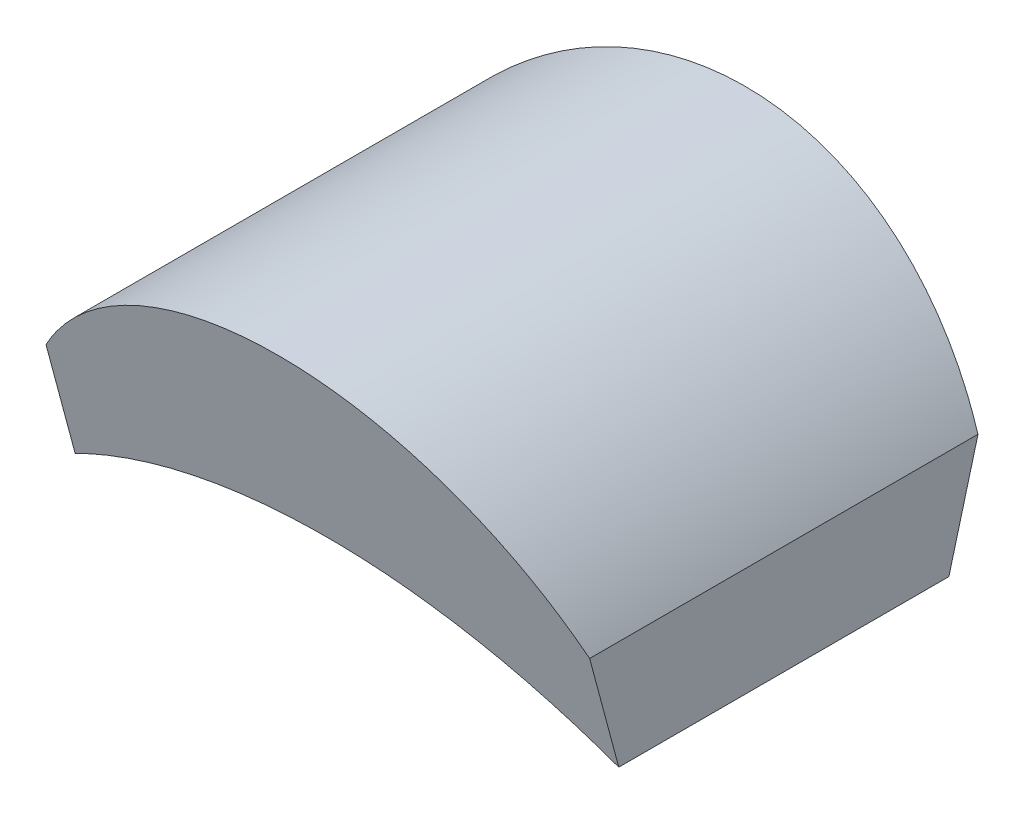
ISO-10303-21;
HEADER;
FILE_DESCRIPTION(('STEP AP214'),'2;1');
FILE_NAME('part.step','',(''),(''),'','','');
FILE_SCHEMA(('AUTOMOTIVE_DESIGN { 1 0 10303 214 1 1 1 1 }'));
ENDSEC;
DATA;
#1=APPLICATION_CONTEXT('core data for automotive mechanical design processes');
#2=APPLICATION_PROTOCOL_DEFINITION('international standard','automotive_design',2000,#1);
#3=PRODUCT_CONTEXT('',#1,'mechanical');
#4=PRODUCT('Part','Part','',(#3));
#5=PRODUCT_RELATED_PRODUCT_CATEGORY('part','',(#4));
#6=PRODUCT_DEFINITION_FORMATION('','',#4);
#7=PRODUCT_DEFINITION_CONTEXT('part definition',#1,'design');
#8=PRODUCT_DEFINITION('design','',#6,#7);
#9=PRODUCT_DEFINITION_SHAPE('','',#8);
#10=(LENGTH_UNIT() NAMED_UNIT(*) SI_UNIT(.MILLI.,.METRE.));
#11=(NAMED_UNIT(*) PLANE_ANGLE_UNIT() SI_UNIT($,.RADIAN.));
#12=(NAMED_UNIT(*) SI_UNIT($,.STERADIAN.) SOLID_ANGLE_UNIT());
#13=UNCERTAINTY_MEASURE_WITH_UNIT(LENGTH_MEASURE(1.E-05),#10,'distance_accuracy_value','');
#14=(GEOMETRIC_REPRESENTATION_CONTEXT(3) GLOBAL_UNCERTAINTY_ASSIGNED_CONTEXT((#13)) GLOBAL_UNIT_ASSIGNED_CONTEXT((#10,
#11,#12)) REPRESENTATION_CONTEXT('',''));
#15=CARTESIAN_POINT('',(0.,0.,0.));
#16=DIRECTION('',(0.,0.,1.));
#17=DIRECTION('',(1.,0.,0.));
#18=AXIS2_PLACEMENT_3D('',#15,#16,#17);
#19=CARTESIAN_POINT('',(0.,-66.6025403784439,-50.));
#20=DIRECTION('',(0.,0.,1.));
#21=DIRECTION('',(1.,0.,0.));
#22=AXIS2_PLACEMENT_3D('',#19,#20,#21);
#23=CYLINDRICAL_SURFACE('',#22,100.);
#24=DIRECTION('',(0.,0.,1.));
#25=VECTOR('',#24,1.);
#26=CARTESIAN_POINT('',(50.,20.,-50.));
#27=LINE('',#26,#25);
#28=CARTESIAN_POINT('',(50.,20.,-30.3589838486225));
#29=VERTEX_POINT('',#28);
#30=CARTESIAN_POINT('',(50.,20.,30.3589838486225));
#31=VERTEX_POINT('',#30);
#32=EDGE_CURVE('E122',#29,#31,#27,.T.);
#33=ORIENTED_EDGE('',*,*,#32,.T.);
#34=CARTESIAN_POINT('',(0.,-66.6025403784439,7.15390309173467));
#35=DIRECTION('',(0.,-0.258819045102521,0.965925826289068));
#36=DIRECTION('',(0.,0.965925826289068,0.258819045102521));
#37=AXIS2_PLACEMENT_3D('',#34,#35,#36);
#38=ELLIPSE('',#37,103.527618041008,100.);
#39=CARTESIAN_POINT('',(-50.,20.,30.3589838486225));
#40=VERTEX_POINT('',#39);
#41=EDGE_CURVE('E190',#31,#40,#38,.T.);
#42=ORIENTED_EDGE('',*,*,#41,.T.);
#43=DIRECTION('',(0.,0.,1.));
#44=VECTOR('',#43,1.);
#45=CARTESIAN_POINT('',(-50.,20.,-50.));
#46=LINE('',#45,#44);
#47=CARTESIAN_POINT('',(-50.,20.,-30.3589838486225));
#48=VERTEX_POINT('',#47);
#49=EDGE_CURVE('E186',#40,#48,#46,.F.);
#50=ORIENTED_EDGE('',*,*,#49,.T.);
#51=CARTESIAN_POINT('',(0.,-66.6025403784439,-7.15390309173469));
#52=DIRECTION('',(0.,-0.258819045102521,-0.965925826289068));
#53=DIRECTION('',(0.,-0.965925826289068,0.258819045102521));
#54=AXIS2_PLACEMENT_3D('',#51,#52,#53);
#55=ELLIPSE('',#54,103.527618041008,100.);
#56=EDGE_CURVE('E184',#29,#48,#55,.F.);
#57=ORIENTED_EDGE('',*,*,#56,.F.);
#58=EDGE_LOOP('',(#33,#42,#50,#57));
#59=FACE_BOUND('',#58,.T.);
#60=CARTESIAN_POINT('',(0.,-66.6025403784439,-6.1186269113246));
#61=DIRECTION('',(0.,-0.258819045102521,-0.965925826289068));
#62=DIRECTION('',(0.,-0.965925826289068,0.258819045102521));
#63=AXIS2_PLACEMENT_3D('',#60,#61,#62);
#64=ELLIPSE('',#63,103.527618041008,100.);
#65=CARTESIAN_POINT('',(-49.,20.5697029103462,-29.4763591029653));
#66=VERTEX_POINT('',#65);
#67=CARTESIAN_POINT('',(49.,20.5697029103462,-29.4763591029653));
#68=VERTEX_POINT('',#67);
#69=EDGE_CURVE('E172',#66,#68,#64,.T.);
#70=ORIENTED_EDGE('',*,*,#69,.F.);
#71=DIRECTION('',(0.,0.,1.));
#72=VECTOR('',#71,1.);
#73=CARTESIAN_POINT('',(-49.,20.5697029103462,-50.));
#74=LINE('',#73,#72);
#75=CARTESIAN_POINT('',(-49.,20.5697029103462,29.4763591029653));
#76=VERTEX_POINT('',#75);
#77=EDGE_CURVE('E168',#66,#76,#74,.T.);
#78=ORIENTED_EDGE('',*,*,#77,.T.);
#79=CARTESIAN_POINT('',(0.,-66.6025403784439,6.11862691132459));
#80=DIRECTION('',(0.,-0.258819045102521,0.965925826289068));
#81=DIRECTION('',(0.,0.965925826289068,0.258819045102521));
#82=AXIS2_PLACEMENT_3D('',#79,#80,#81);
#83=ELLIPSE('',#82,103.527618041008,100.);
#84=CARTESIAN_POINT('',(49.,20.5697029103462,29.4763591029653));
#85=VERTEX_POINT('',#84);
#86=EDGE_CURVE('E160',#76,#85,#83,.F.);
#87=ORIENTED_EDGE('',*,*,#86,.T.);
#88=DIRECTION('',(0.,0.,1.));
#89=VECTOR('',#88,1.);
#90=CARTESIAN_POINT('',(49.,20.5697029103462,-50.));
#91=LINE('',#90,#89);
#92=EDGE_CURVE('E164',#85,#68,#91,.F.);
#93=ORIENTED_EDGE('',*,*,#92,.T.);
#94=EDGE_LOOP('',(#70,#78,#87,#93));
#95=FACE_BOUND('',#94,.T.);
#96=ADVANCED_FACE('F36',(#59,#95),#23,.F.);
#97=CARTESIAN_POINT('',(0.,-66.6025403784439,-50.));
#98=DIRECTION('',(0.,0.,1.));
#99=DIRECTION('',(1.,0.,0.));
#100=AXIS2_PLACEMENT_3D('',#97,#98,#99);
#101=CYLINDRICAL_SURFACE('',#100,101.);
#102=DIRECTION('',(0.,0.,1.));
#103=VECTOR('',#102,1.);
#104=CARTESIAN_POINT('',(-49.,21.7150682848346,-50.));
#105=LINE('',#104,#103);
#106=CARTESIAN_POINT('',(-49.,21.7150682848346,29.783258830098));
#107=VERTEX_POINT('',#106);
#108=CARTESIAN_POINT('',(-49.,21.7150682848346,-29.7832588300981));
#109=VERTEX_POINT('',#108);
#110=EDGE_CURVE('E148',#107,#109,#105,.F.);
#111=ORIENTED_EDGE('',*,*,#110,.T.);
#112=CARTESIAN_POINT('',(0.,-66.6025403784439,-6.1186269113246));
#113=DIRECTION('',(0.,-0.258819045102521,-0.965925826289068));
#114=DIRECTION('',(0.,-0.965925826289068,0.258819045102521));
#115=AXIS2_PLACEMENT_3D('',#112,#113,#114);
#116=ELLIPSE('',#115,104.562894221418,101.);
#117=CARTESIAN_POINT('',(49.,21.7150682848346,-29.7832588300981));
#118=VERTEX_POINT('',#117);
#119=EDGE_CURVE('E145',#118,#109,#116,.F.);
#120=ORIENTED_EDGE('',*,*,#119,.F.);
#121=DIRECTION('',(0.,0.,1.));
#122=VECTOR('',#121,1.);
#123=CARTESIAN_POINT('',(49.,21.7150682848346,-50.));
#124=LINE('',#123,#122);
#125=CARTESIAN_POINT('',(49.,21.7150682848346,29.7832588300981));
#126=VERTEX_POINT('',#125);
#127=EDGE_CURVE('E152',#118,#126,#124,.T.);
#128=ORIENTED_EDGE('',*,*,#127,.T.);
#129=CARTESIAN_POINT('',(0.,-66.6025403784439,6.11862691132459));
#130=DIRECTION('',(0.,-0.258819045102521,0.965925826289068));
#131=DIRECTION('',(0.,0.965925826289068,0.258819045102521));
#132=AXIS2_PLACEMENT_3D('',#129,#130,#131);
#133=ELLIPSE('',#132,104.562894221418,101.);
#134=EDGE_CURVE('E156',#126,#107,#133,.T.);
#135=ORIENTED_EDGE('',*,*,#134,.T.);
#136=EDGE_LOOP('',(#111,#120,#128,#135));
#137=FACE_BOUND('',#136,.T.);
#138=CARTESIAN_POINT('',(0.,-66.6025403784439,5.08335073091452));
#139=DIRECTION('',(0.,-0.258819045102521,0.965925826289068));
#140=DIRECTION('',(0.,0.965925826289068,0.258819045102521));
#141=AXIS2_PLACEMENT_3D('',#138,#139,#140);
#142=ELLIPSE('',#141,104.562894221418,101.);
#143=CARTESIAN_POINT('',(48.,22.2625258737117,28.8946734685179));
#144=VERTEX_POINT('',#143);
#145=CARTESIAN_POINT('',(-48.,22.2625258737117,28.8946734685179));
#146=VERTEX_POINT('',#145);
#147=EDGE_CURVE('E175',#144,#146,#142,.T.);
#148=ORIENTED_EDGE('',*,*,#147,.F.);
#149=DIRECTION('',(0.,0.,1.));
#150=VECTOR('',#149,1.);
#151=CARTESIAN_POINT('',(48.,22.2625258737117,-50.));
#152=LINE('',#151,#150);
#153=CARTESIAN_POINT('',(48.,22.2625258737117,-28.8946734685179));
#154=VERTEX_POINT('',#153);
#155=EDGE_CURVE('E178',#154,#144,#152,.T.);
#156=ORIENTED_EDGE('',*,*,#155,.F.);
#157=CARTESIAN_POINT('',(0.,-66.6025403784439,-5.08335073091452));
#158=DIRECTION('',(0.,-0.258819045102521,-0.965925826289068));
#159=DIRECTION('',(0.,-0.965925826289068,0.258819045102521));
#160=AXIS2_PLACEMENT_3D('',#157,#158,#159);
#161=ELLIPSE('',#160,104.562894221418,101.);
#162=CARTESIAN_POINT('',(-48.,22.2625258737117,-28.8946734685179));
#163=VERTEX_POINT('',#162);
#164=EDGE_CURVE('E193',#154,#163,#161,.F.);
#165=ORIENTED_EDGE('',*,*,#164,.T.);
#166=DIRECTION('',(0.,0.,1.));
#167=VECTOR('',#166,1.);
#168=CARTESIAN_POINT('',(-48.,22.2625258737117,-50.));
#169=LINE('',#168,#167);
#170=EDGE_CURVE('E181',#146,#163,#169,.F.);
#171=ORIENTED_EDGE('',*,*,#170,.F.);
#172=EDGE_LOOP('',(#148,#156,#165,#171));
#173=FACE_BOUND('',#172,.T.);
#174=ADVANCED_FACE('F233',(#137,#173),#101,.F.);
#175=CARTESIAN_POINT('',(-49.,0.,25.));
#176=DIRECTION('',(1.,0.,0.));
#177=DIRECTION('',(0.,0.,-1.));
#178=AXIS2_PLACEMENT_3D('',#175,#176,#177);
#179=PLANE('',#178);
#180=DIRECTION('',(0.,0.965925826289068,0.258819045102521));
#181=VECTOR('',#180,1.);
#182=CARTESIAN_POINT('',(-49.,0.258819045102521,24.0340741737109));
#183=LINE('',#182,#181);
#184=EDGE_CURVE('E11',#107,#76,#183,.F.);
#185=ORIENTED_EDGE('',*,*,#184,.T.);
#186=ORIENTED_EDGE('',*,*,#77,.F.);
#187=DIRECTION('',(0.,-0.965925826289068,0.258819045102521));
#188=VECTOR('',#187,1.);
#189=CARTESIAN_POINT('',(-49.,0.258819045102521,-24.0340741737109));
#190=LINE('',#189,#188);
#191=EDGE_CURVE('E143',#109,#66,#190,.T.);
#192=ORIENTED_EDGE('',*,*,#191,.F.);
#193=ORIENTED_EDGE('',*,*,#110,.F.);
#194=EDGE_LOOP('',(#185,#186,#192,#193));
#195=FACE_BOUND('',#194,.T.);
#196=ADVANCED_FACE('F231',(#195),#179,.T.);
#197=CARTESIAN_POINT('',(-50.,0.258819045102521,-24.0340741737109));
#198=DIRECTION('',(0.,-0.258819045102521,-0.965925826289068));
#199=DIRECTION('',(0.,0.965925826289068,-0.258819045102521));
#200=AXIS2_PLACEMENT_3D('',#197,#198,#199);
#201=PLANE('',#200);
#202=ORIENTED_EDGE('',*,*,#119,.T.);
#203=ORIENTED_EDGE('',*,*,#191,.T.);
#204=ORIENTED_EDGE('',*,*,#69,.T.);
#205=DIRECTION('',(0.,0.965925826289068,-0.258819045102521));
#206=VECTOR('',#205,1.);
#207=CARTESIAN_POINT('',(49.,0.258819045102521,-24.0340741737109));
#208=LINE('',#207,#206);
#209=EDGE_CURVE('E55',#68,#118,#208,.T.);
#210=ORIENTED_EDGE('',*,*,#209,.T.);
#211=EDGE_LOOP('',(#202,#203,#204,#210));
#212=FACE_BOUND('',#211,.T.);
#213=ADVANCED_FACE('F240',(#212),#201,.F.);
#214=CARTESIAN_POINT('',(49.,0.,25.));
#215=DIRECTION('',(-1.,0.,0.));
#216=DIRECTION('',(0.,0.,1.));
#217=AXIS2_PLACEMENT_3D('',#214,#215,#216);
#218=PLANE('',#217);
#219=ORIENTED_EDGE('',*,*,#209,.F.);
#220=ORIENTED_EDGE('',*,*,#92,.F.);
#221=DIRECTION('',(0.,-0.965925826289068,-0.258819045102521));
#222=VECTOR('',#221,1.);
#223=CARTESIAN_POINT('',(49.,0.258819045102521,24.0340741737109));
#224=LINE('',#223,#222);
#225=EDGE_CURVE('E46',#85,#126,#224,.F.);
#226=ORIENTED_EDGE('',*,*,#225,.T.);
#227=ORIENTED_EDGE('',*,*,#127,.F.);
#228=EDGE_LOOP('',(#219,#220,#226,#227));
#229=FACE_BOUND('',#228,.T.);
#230=ADVANCED_FACE('F237',(#229),#218,.T.);
#231=CARTESIAN_POINT('',(-50.,0.258819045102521,24.0340741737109));
#232=DIRECTION('',(0.,-0.258819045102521,0.965925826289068));
#233=DIRECTION('',(0.,-0.965925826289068,-0.258819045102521));
#234=AXIS2_PLACEMENT_3D('',#231,#232,#233);
#235=PLANE('',#234);
#236=ORIENTED_EDGE('',*,*,#225,.F.);
#237=ORIENTED_EDGE('',*,*,#86,.F.);
#238=ORIENTED_EDGE('',*,*,#184,.F.);
#239=ORIENTED_EDGE('',*,*,#134,.F.);
#240=EDGE_LOOP('',(#236,#237,#238,#239));
#241=FACE_BOUND('',#240,.T.);
#242=ADVANCED_FACE('F228',(#241),#235,.F.);
#243=CARTESIAN_POINT('',(-48.,0.,25.));
#244=DIRECTION('',(1.,0.,0.));
#245=DIRECTION('',(0.,0.,-1.));
#246=AXIS2_PLACEMENT_3D('',#243,#244,#245);
#247=PLANE('',#246);
#248=DIRECTION('',(0.,0.965925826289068,0.258819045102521));
#249=VECTOR('',#248,1.);
#250=CARTESIAN_POINT('',(-48.,0.517638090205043,23.0681483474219));
#251=LINE('',#250,#249);
#252=CARTESIAN_POINT('',(-48.,39.3913932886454,33.4843396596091));
#253=VERTEX_POINT('',#252);
#254=EDGE_CURVE('E198',#253,#146,#251,.F.);
#255=ORIENTED_EDGE('',*,*,#254,.T.);
#256=ORIENTED_EDGE('',*,*,#170,.T.);
#257=DIRECTION('',(0.,-0.965925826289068,0.258819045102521));
#258=VECTOR('',#257,1.);
#259=CARTESIAN_POINT('',(-48.,0.517638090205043,-23.0681483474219));
#260=LINE('',#259,#258);
#261=CARTESIAN_POINT('',(-48.,39.3913932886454,-33.4843396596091));
#262=VERTEX_POINT('',#261);
#263=EDGE_CURVE('E127',#262,#163,#260,.T.);
#264=ORIENTED_EDGE('',*,*,#263,.F.);
#265=DIRECTION('',(0.,0.,-1.));
#266=VECTOR('',#265,1.);
#267=CARTESIAN_POINT('',(-48.,39.3913932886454,33.4843396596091));
#268=LINE('',#267,#266);
#269=EDGE_CURVE('E204',#253,#262,#268,.T.);
#270=ORIENTED_EDGE('',*,*,#269,.F.);
#271=EDGE_LOOP('',(#255,#256,#264,#270));
#272=FACE_BOUND('',#271,.T.);
#273=ADVANCED_FACE('F255',(#272),#247,.T.);
#274=CARTESIAN_POINT('',(48.,0.,25.));
#275=DIRECTION('',(-1.,0.,0.));
#276=DIRECTION('',(0.,0.,1.));
#277=AXIS2_PLACEMENT_3D('',#274,#275,#276);
#278=PLANE('',#277);
#279=DIRECTION('',(0.,0.965925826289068,-0.258819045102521));
#280=VECTOR('',#279,1.);
#281=CARTESIAN_POINT('',(48.,0.517638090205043,-23.0681483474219));
#282=LINE('',#281,#280);
#283=CARTESIAN_POINT('',(48.,39.3913932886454,-33.4843396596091));
#284=VERTEX_POINT('',#283);
#285=EDGE_CURVE('E202',#154,#284,#282,.T.);
#286=ORIENTED_EDGE('',*,*,#285,.F.);
#287=ORIENTED_EDGE('',*,*,#155,.T.);
#288=DIRECTION('',(0.,-0.965925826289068,-0.258819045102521));
#289=VECTOR('',#288,1.);
#290=CARTESIAN_POINT('',(48.,0.517638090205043,23.0681483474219));
#291=LINE('',#290,#289);
#292=CARTESIAN_POINT('',(48.,39.3913932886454,33.4843396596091));
#293=VERTEX_POINT('',#292);
#294=EDGE_CURVE('E196',#144,#293,#291,.F.);
#295=ORIENTED_EDGE('',*,*,#294,.T.);
#296=DIRECTION('',(0.,0.,-1.));
#297=VECTOR('',#296,1.);
#298=CARTESIAN_POINT('',(48.,39.3913932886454,33.4843396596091));
#299=LINE('',#298,#297);
#300=EDGE_CURVE('E201',#293,#284,#299,.T.);
#301=ORIENTED_EDGE('',*,*,#300,.T.);
#302=EDGE_LOOP('',(#286,#287,#295,#301));
#303=FACE_BOUND('',#302,.T.);
#304=ADVANCED_FACE('F257',(#303),#278,.T.);
#305=CARTESIAN_POINT('',(-50.,0.517638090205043,23.0681483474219));
#306=DIRECTION('',(0.,-0.258819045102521,0.965925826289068));
#307=DIRECTION('',(0.,-0.965925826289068,-0.258819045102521));
#308=AXIS2_PLACEMENT_3D('',#305,#306,#307);
#309=PLANE('',#308);
#310=ORIENTED_EDGE('',*,*,#294,.F.);
#311=ORIENTED_EDGE('',*,*,#147,.T.);
#312=ORIENTED_EDGE('',*,*,#254,.F.);
#313=CARTESIAN_POINT('',(0.,6.83375209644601,24.760545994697));
#314=DIRECTION('',(0.,-0.258819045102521,0.965925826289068));
#315=DIRECTION('',(0.,-0.965925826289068,-0.258819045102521));
#316=AXIS2_PLACEMENT_3D('',#313,#314,#315);
#317=ELLIPSE('',#316,60.0460184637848,58.);
#318=EDGE_CURVE('E177',#293,#253,#317,.T.);
#319=ORIENTED_EDGE('',*,*,#318,.F.);
#320=EDGE_LOOP('',(#310,#311,#312,#319));
#321=FACE_BOUND('',#320,.T.);
#322=ADVANCED_FACE('F264',(#321),#309,.F.);
#323=CARTESIAN_POINT('',(-50.,0.517638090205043,-23.0681483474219));
#324=DIRECTION('',(0.,-0.258819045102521,-0.965925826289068));
#325=DIRECTION('',(0.,0.965925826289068,-0.258819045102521));
#326=AXIS2_PLACEMENT_3D('',#323,#324,#325);
#327=PLANE('',#326);
#328=ORIENTED_EDGE('',*,*,#164,.F.);
#329=ORIENTED_EDGE('',*,*,#285,.T.);
#330=CARTESIAN_POINT('',(0.,6.83375209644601,-24.760545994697));
#331=DIRECTION('',(0.,-0.258819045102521,-0.965925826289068));
#332=DIRECTION('',(0.,0.965925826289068,-0.258819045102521));
#333=AXIS2_PLACEMENT_3D('',#330,#331,#332);
#334=ELLIPSE('',#333,60.0460184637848,58.);
#335=EDGE_CURVE('E205',#284,#262,#334,.F.);
#336=ORIENTED_EDGE('',*,*,#335,.T.);
#337=ORIENTED_EDGE('',*,*,#263,.T.);
#338=EDGE_LOOP('',(#328,#329,#336,#337));
#339=FACE_BOUND('',#338,.T.);
#340=ADVANCED_FACE('F269',(#339),#327,.F.);
#341=CARTESIAN_POINT('',(0.,6.83375209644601,25.));
#342=DIRECTION('',(0.,0.,-1.));
#343=DIRECTION('',(-1.,0.,0.));
#344=AXIS2_PLACEMENT_3D('',#341,#342,#343);
#345=CYLINDRICAL_SURFACE('',#344,58.);
#346=ORIENTED_EDGE('',*,*,#335,.F.);
#347=ORIENTED_EDGE('',*,*,#300,.F.);
#348=ORIENTED_EDGE('',*,*,#318,.T.);
#349=ORIENTED_EDGE('',*,*,#269,.T.);
#350=EDGE_LOOP('',(#346,#347,#348,#349));
#351=FACE_BOUND('',#350,.T.);
#352=ADVANCED_FACE('F252',(#351),#345,.F.);
#353=CARTESIAN_POINT('',(0.,6.83375209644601,25.));
#354=DIRECTION('',(0.,0.,-1.));
#355=DIRECTION('',(-1.,0.,0.));
#356=AXIS2_PLACEMENT_3D('',#353,#354,#355);
#357=CYLINDRICAL_SURFACE('',#356,60.);
#358=CARTESIAN_POINT('',(0.,6.83375209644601,-26.8310983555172));
#359=DIRECTION('',(0.,-0.258819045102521,-0.965925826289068));
#360=DIRECTION('',(0.,0.965925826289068,-0.258819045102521));
#361=AXIS2_PLACEMENT_3D('',#358,#359,#360);
#362=ELLIPSE('',#361,62.116570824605,60.);
#363=CARTESIAN_POINT('',(50.,40.,-35.7179676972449));
#364=VERTEX_POINT('',#363);
#365=CARTESIAN_POINT('',(-50.,40.,-35.7179676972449));
#366=VERTEX_POINT('',#365);
#367=EDGE_CURVE('E109',#364,#366,#362,.F.);
#368=ORIENTED_EDGE('',*,*,#367,.T.);
#369=DIRECTION('',(0.,0.,-1.));
#370=VECTOR('',#369,1.);
#371=CARTESIAN_POINT('',(-50.,40.,25.));
#372=LINE('',#371,#370);
#373=CARTESIAN_POINT('',(-50.,40.,35.7179676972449));
#374=VERTEX_POINT('',#373);
#375=EDGE_CURVE('E126',#374,#366,#372,.T.);
#376=ORIENTED_EDGE('',*,*,#375,.F.);
#377=CARTESIAN_POINT('',(0.,6.83375209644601,26.8310983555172));
#378=DIRECTION('',(0.,-0.258819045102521,0.965925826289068));
#379=DIRECTION('',(0.,-0.965925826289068,-0.258819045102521));
#380=AXIS2_PLACEMENT_3D('',#377,#378,#379);
#381=ELLIPSE('',#380,62.116570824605,60.);
#382=CARTESIAN_POINT('',(50.,40.,35.7179676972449));
#383=VERTEX_POINT('',#382);
#384=EDGE_CURVE('E125',#383,#374,#381,.T.);
#385=ORIENTED_EDGE('',*,*,#384,.F.);
#386=DIRECTION('',(0.,0.,-1.));
#387=VECTOR('',#386,1.);
#388=CARTESIAN_POINT('',(50.,40.,25.));
#389=LINE('',#388,#387);
#390=EDGE_CURVE('E119',#383,#364,#389,.T.);
#391=ORIENTED_EDGE('',*,*,#390,.T.);
#392=EDGE_LOOP('',(#368,#376,#385,#391));
#393=FACE_BOUND('',#392,.T.);
#394=ADVANCED_FACE('F124',(#393),#357,.T.);
#395=CARTESIAN_POINT('',(-50.,0.,25.));
#396=DIRECTION('',(1.,0.,0.));
#397=DIRECTION('',(0.,0.,-1.));
#398=AXIS2_PLACEMENT_3D('',#395,#396,#397);
#399=PLANE('',#398);
#400=ORIENTED_EDGE('',*,*,#49,.F.);
#401=DIRECTION('',(0.,0.965925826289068,0.258819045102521));
#402=VECTOR('',#401,1.);
#403=CARTESIAN_POINT('',(-50.,0.,25.));
#404=LINE('',#403,#402);
#405=EDGE_CURVE('E131',#374,#40,#404,.F.);
#406=ORIENTED_EDGE('',*,*,#405,.F.);
#407=ORIENTED_EDGE('',*,*,#375,.T.);
#408=DIRECTION('',(0.,-0.965925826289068,0.258819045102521));
#409=VECTOR('',#408,1.);
#410=CARTESIAN_POINT('',(-50.,0.,-25.));
#411=LINE('',#410,#409);
#412=EDGE_CURVE('E40',#366,#48,#411,.T.);
#413=ORIENTED_EDGE('',*,*,#412,.T.);
#414=EDGE_LOOP('',(#400,#406,#407,#413));
#415=FACE_BOUND('',#414,.T.);
#416=ADVANCED_FACE('F215',(#415),#399,.F.);
#417=CARTESIAN_POINT('',(50.,0.,25.));
#418=DIRECTION('',(-1.,0.,0.));
#419=DIRECTION('',(0.,0.,1.));
#420=AXIS2_PLACEMENT_3D('',#417,#418,#419);
#421=PLANE('',#420);
#422=ORIENTED_EDGE('',*,*,#32,.F.);
#423=DIRECTION('',(0.,0.965925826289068,-0.258819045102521));
#424=VECTOR('',#423,1.);
#425=CARTESIAN_POINT('',(50.,0.,-25.));
#426=LINE('',#425,#424);
#427=EDGE_CURVE('E116',#29,#364,#426,.T.);
#428=ORIENTED_EDGE('',*,*,#427,.T.);
#429=ORIENTED_EDGE('',*,*,#390,.F.);
#430=DIRECTION('',(0.,-0.965925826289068,-0.258819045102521));
#431=VECTOR('',#430,1.);
#432=CARTESIAN_POINT('',(50.,0.,25.));
#433=LINE('',#432,#431);
#434=EDGE_CURVE('E134',#31,#383,#433,.F.);
#435=ORIENTED_EDGE('',*,*,#434,.F.);
#436=EDGE_LOOP('',(#422,#428,#429,#435));
#437=FACE_BOUND('',#436,.T.);
#438=ADVANCED_FACE('F117',(#437),#421,.F.);
#439=CARTESIAN_POINT('',(-50.,0.,-25.));
#440=DIRECTION('',(0.,-0.258819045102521,-0.965925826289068));
#441=DIRECTION('',(0.,0.965925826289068,-0.258819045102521));
#442=AXIS2_PLACEMENT_3D('',#439,#440,#441);
#443=PLANE('',#442);
#444=ORIENTED_EDGE('',*,*,#427,.F.);
#445=ORIENTED_EDGE('',*,*,#56,.T.);
#446=ORIENTED_EDGE('',*,*,#412,.F.);
#447=ORIENTED_EDGE('',*,*,#367,.F.);
#448=EDGE_LOOP('',(#444,#445,#446,#447));
#449=FACE_BOUND('',#448,.T.);
#450=ADVANCED_FACE('F38',(#449),#443,.T.);
#451=CARTESIAN_POINT('',(-50.,0.,25.));
#452=DIRECTION('',(0.,-0.258819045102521,0.965925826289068));
#453=DIRECTION('',(0.,-0.965925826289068,-0.258819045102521));
#454=AXIS2_PLACEMENT_3D('',#451,#452,#453);
#455=PLANE('',#454);
#456=ORIENTED_EDGE('',*,*,#41,.F.);
#457=ORIENTED_EDGE('',*,*,#434,.T.);
#458=ORIENTED_EDGE('',*,*,#384,.T.);
#459=ORIENTED_EDGE('',*,*,#405,.T.);
#460=EDGE_LOOP('',(#456,#457,#458,#459));
#461=FACE_BOUND('',#460,.T.);
#462=ADVANCED_FACE('F210',(#461),#455,.T.);
#463=CLOSED_SHELL('',(#96,#174,#196,#213,#230,#242,#273,#304,#322,#340,#352,#394,#416,#438,#450,#462));
#464=MANIFOLD_SOLID_BREP('B2',#463);
#465=ADVANCED_BREP_SHAPE_REPRESENTATION('',(#18,#464),#14);
#466=SHAPE_DEFINITION_REPRESENTATION(#9,#465);
ENDSEC;
END-ISO-10303-21;
